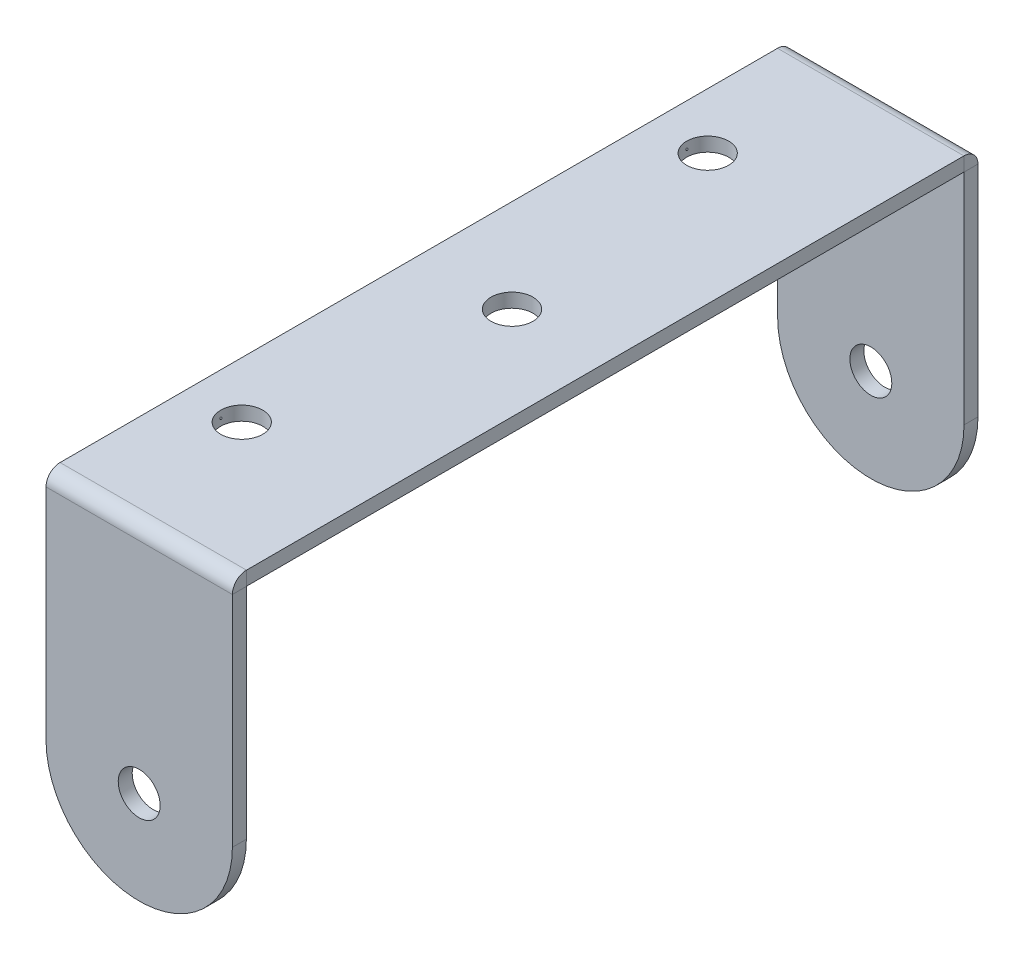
ISO-10303-21;
HEADER;
FILE_DESCRIPTION(('STEP AP214'),'2;1');
FILE_NAME('part.step','',(''),(''),'','','');
FILE_SCHEMA(('AUTOMOTIVE_DESIGN { 1 0 10303 214 1 1 1 1 }'));
ENDSEC;
DATA;
#1=APPLICATION_CONTEXT('core data for automotive mechanical design processes');
#2=APPLICATION_PROTOCOL_DEFINITION('international standard','automotive_design',2000,#1);
#3=PRODUCT_CONTEXT('',#1,'mechanical');
#4=PRODUCT('Part','Part','',(#3));
#5=PRODUCT_RELATED_PRODUCT_CATEGORY('part','',(#4));
#6=PRODUCT_DEFINITION_FORMATION('','',#4);
#7=PRODUCT_DEFINITION_CONTEXT('part definition',#1,'design');
#8=PRODUCT_DEFINITION('design','',#6,#7);
#9=PRODUCT_DEFINITION_SHAPE('','',#8);
#10=(LENGTH_UNIT() NAMED_UNIT(*) SI_UNIT(.MILLI.,.METRE.));
#11=(NAMED_UNIT(*) PLANE_ANGLE_UNIT() SI_UNIT($,.RADIAN.));
#12=(NAMED_UNIT(*) SI_UNIT($,.STERADIAN.) SOLID_ANGLE_UNIT());
#13=UNCERTAINTY_MEASURE_WITH_UNIT(LENGTH_MEASURE(1.E-05),#10,'distance_accuracy_value','');
#14=(GEOMETRIC_REPRESENTATION_CONTEXT(3) GLOBAL_UNCERTAINTY_ASSIGNED_CONTEXT((#13)) GLOBAL_UNIT_ASSIGNED_CONTEXT((#10,
#11,#12)) REPRESENTATION_CONTEXT('',''));
#15=CARTESIAN_POINT('',(0.,0.,0.));
#16=DIRECTION('',(0.,0.,1.));
#17=DIRECTION('',(1.,0.,0.));
#18=AXIS2_PLACEMENT_3D('',#15,#16,#17);
#19=CARTESIAN_POINT('',(10.,1.5,65.));
#20=DIRECTION('',(0.,1.,0.));
#21=DIRECTION('',(0.,0.,1.));
#22=AXIS2_PLACEMENT_3D('',#19,#20,#21);
#23=PLANE('',#22);
#24=CARTESIAN_POINT('',(6.,1.5,-25.));
#25=DIRECTION('',(0.,1.,0.));
#26=DIRECTION('',(0.,0.,1.));
#27=AXIS2_PLACEMENT_3D('',#24,#25,#26);
#28=CIRCLE('',#27,2.25);
#29=CARTESIAN_POINT('',(6.,1.5,-22.75));
#30=VERTEX_POINT('',#29);
#31=EDGE_CURVE('E241',#30,#30,#28,.T.);
#32=ORIENTED_EDGE('',*,*,#31,.F.);
#33=EDGE_LOOP('',(#32));
#34=FACE_BOUND('',#33,.T.);
#35=CARTESIAN_POINT('',(10.,1.5,0.));
#36=DIRECTION('',(0.,1.,0.));
#37=DIRECTION('',(0.,0.,1.));
#38=AXIS2_PLACEMENT_3D('',#35,#36,#37);
#39=CIRCLE('',#38,2.25);
#40=CARTESIAN_POINT('',(10.,1.5,2.25));
#41=VERTEX_POINT('',#40);
#42=EDGE_CURVE('E247',#41,#41,#39,.T.);
#43=ORIENTED_EDGE('',*,*,#42,.F.);
#44=EDGE_LOOP('',(#43));
#45=FACE_BOUND('',#44,.T.);
#46=CARTESIAN_POINT('',(6.,1.5,25.));
#47=DIRECTION('',(0.,1.,0.));
#48=DIRECTION('',(0.,0.,1.));
#49=AXIS2_PLACEMENT_3D('',#46,#47,#48);
#50=CIRCLE('',#49,2.25);
#51=CARTESIAN_POINT('',(6.,1.5,27.25));
#52=VERTEX_POINT('',#51);
#53=EDGE_CURVE('E235',#52,#52,#50,.T.);
#54=ORIENTED_EDGE('',*,*,#53,.F.);
#55=EDGE_LOOP('',(#54));
#56=FACE_BOUND('',#55,.T.);
#57=DIRECTION('',(0.,0.,-1.));
#58=VECTOR('',#57,1.);
#59=CARTESIAN_POINT('',(20.,1.5,65.));
#60=LINE('',#59,#58);
#61=CARTESIAN_POINT('',(20.,1.50000001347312,38.495));
#62=VERTEX_POINT('',#61);
#63=CARTESIAN_POINT('',(20.,1.5,-38.495));
#64=VERTEX_POINT('',#63);
#65=EDGE_CURVE('E273',#62,#64,#60,.T.);
#66=ORIENTED_EDGE('',*,*,#65,.T.);
#67=DIRECTION('',(-1.,0.,0.));
#68=VECTOR('',#67,1.);
#69=CARTESIAN_POINT('',(10.,1.5,-38.495));
#70=LINE('',#69,#68);
#71=CARTESIAN_POINT('',(0.,1.50000002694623,-38.495));
#72=VERTEX_POINT('',#71);
#73=EDGE_CURVE('E260',#64,#72,#70,.T.);
#74=ORIENTED_EDGE('',*,*,#73,.T.);
#75=DIRECTION('',(0.,0.,1.));
#76=VECTOR('',#75,1.);
#77=CARTESIAN_POINT('',(0.,1.5,-65.));
#78=LINE('',#77,#76);
#79=CARTESIAN_POINT('',(0.,1.50000002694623,38.495));
#80=VERTEX_POINT('',#79);
#81=EDGE_CURVE('E253',#72,#80,#78,.T.);
#82=ORIENTED_EDGE('',*,*,#81,.T.);
#83=DIRECTION('',(-1.,0.,0.));
#84=VECTOR('',#83,1.);
#85=CARTESIAN_POINT('',(10.,1.5,38.495));
#86=LINE('',#85,#84);
#87=EDGE_CURVE('E250',#62,#80,#86,.T.);
#88=ORIENTED_EDGE('',*,*,#87,.F.);
#89=EDGE_LOOP('',(#66,#74,#82,#88));
#90=FACE_BOUND('',#89,.T.);
#91=ADVANCED_FACE('F40',(#34,#45,#56,#90),#23,.T.);
#92=CARTESIAN_POINT('',(0.,1.5,-65.));
#93=DIRECTION('',(1.,0.,0.));
#94=DIRECTION('',(0.,0.,-1.));
#95=AXIS2_PLACEMENT_3D('',#92,#93,#94);
#96=PLANE('',#95);
#97=DIRECTION('',(0.,1.,0.));
#98=VECTOR('',#97,1.);
#99=CARTESIAN_POINT('',(0.,1.5,-38.495));
#100=LINE('',#99,#98);
#101=CARTESIAN_POINT('',(0.,0.,-38.495));
#102=VERTEX_POINT('',#101);
#103=EDGE_CURVE('E269',#102,#72,#100,.T.);
#104=ORIENTED_EDGE('',*,*,#103,.F.);
#105=DIRECTION('',(0.,0.,1.));
#106=VECTOR('',#105,1.);
#107=CARTESIAN_POINT('',(0.,0.,-65.));
#108=LINE('',#107,#106);
#109=CARTESIAN_POINT('',(0.,2.69462321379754E-08,38.495));
#110=VERTEX_POINT('',#109);
#111=EDGE_CURVE('E59',#102,#110,#108,.T.);
#112=ORIENTED_EDGE('',*,*,#111,.T.);
#113=DIRECTION('',(0.,1.,0.));
#114=VECTOR('',#113,1.);
#115=CARTESIAN_POINT('',(0.,1.50000000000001,38.495));
#116=LINE('',#115,#114);
#117=EDGE_CURVE('E252',#110,#80,#116,.T.);
#118=ORIENTED_EDGE('',*,*,#117,.T.);
#119=ORIENTED_EDGE('',*,*,#81,.F.);
#120=EDGE_LOOP('',(#104,#112,#118,#119));
#121=FACE_BOUND('',#120,.T.);
#122=ADVANCED_FACE('F42',(#121),#96,.F.);
#123=CARTESIAN_POINT('',(20.,1.5,65.));
#124=DIRECTION('',(-1.,0.,0.));
#125=DIRECTION('',(0.,0.,1.));
#126=AXIS2_PLACEMENT_3D('',#123,#124,#125);
#127=PLANE('',#126);
#128=DIRECTION('',(0.,-1.,0.));
#129=VECTOR('',#128,1.);
#130=CARTESIAN_POINT('',(20.,1.49999999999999,-38.495));
#131=LINE('',#130,#129);
#132=CARTESIAN_POINT('',(20.,0.,-38.495));
#133=VERTEX_POINT('',#132);
#134=EDGE_CURVE('E263',#64,#133,#131,.T.);
#135=ORIENTED_EDGE('',*,*,#134,.F.);
#136=ORIENTED_EDGE('',*,*,#65,.F.);
#137=DIRECTION('',(0.,-1.,0.));
#138=VECTOR('',#137,1.);
#139=CARTESIAN_POINT('',(20.,1.5,38.495));
#140=LINE('',#139,#138);
#141=CARTESIAN_POINT('',(20.,0.,38.495));
#142=VERTEX_POINT('',#141);
#143=EDGE_CURVE('E258',#62,#142,#140,.T.);
#144=ORIENTED_EDGE('',*,*,#143,.T.);
#145=DIRECTION('',(0.,0.,-1.));
#146=VECTOR('',#145,1.);
#147=CARTESIAN_POINT('',(20.,0.,65.));
#148=LINE('',#147,#146);
#149=EDGE_CURVE('E67',#142,#133,#148,.T.);
#150=ORIENTED_EDGE('',*,*,#149,.T.);
#151=EDGE_LOOP('',(#135,#136,#144,#150));
#152=FACE_BOUND('',#151,.T.);
#153=ADVANCED_FACE('F373',(#152),#127,.F.);
#154=CARTESIAN_POINT('',(10.,0.,65.));
#155=DIRECTION('',(0.,1.,0.));
#156=DIRECTION('',(0.,0.,1.));
#157=AXIS2_PLACEMENT_3D('',#154,#155,#156);
#158=PLANE('',#157);
#159=DIRECTION('',(-1.,0.,0.));
#160=VECTOR('',#159,1.);
#161=CARTESIAN_POINT('',(10.,0.,-38.495));
#162=LINE('',#161,#160);
#163=EDGE_CURVE('E266',#133,#102,#162,.T.);
#164=ORIENTED_EDGE('',*,*,#163,.F.);
#165=ORIENTED_EDGE('',*,*,#149,.F.);
#166=DIRECTION('',(-1.,0.,0.));
#167=VECTOR('',#166,1.);
#168=CARTESIAN_POINT('',(10.,0.,38.495));
#169=LINE('',#168,#167);
#170=EDGE_CURVE('E256',#142,#110,#169,.T.);
#171=ORIENTED_EDGE('',*,*,#170,.T.);
#172=ORIENTED_EDGE('',*,*,#111,.F.);
#173=EDGE_LOOP('',(#164,#165,#171,#172));
#174=FACE_BOUND('',#173,.T.);
#175=CARTESIAN_POINT('',(6.,0.,25.));
#176=DIRECTION('',(0.,1.,0.));
#177=DIRECTION('',(0.,0.,1.));
#178=AXIS2_PLACEMENT_3D('',#175,#176,#177);
#179=CIRCLE('',#178,2.25);
#180=CARTESIAN_POINT('',(6.,0.,27.25));
#181=VERTEX_POINT('',#180);
#182=EDGE_CURVE('E232',#181,#181,#179,.T.);
#183=ORIENTED_EDGE('',*,*,#182,.T.);
#184=EDGE_LOOP('',(#183));
#185=FACE_BOUND('',#184,.T.);
#186=CARTESIAN_POINT('',(10.,0.,0.));
#187=DIRECTION('',(0.,1.,0.));
#188=DIRECTION('',(0.,0.,1.));
#189=AXIS2_PLACEMENT_3D('',#186,#187,#188);
#190=CIRCLE('',#189,2.25);
#191=CARTESIAN_POINT('',(10.,0.,2.25));
#192=VERTEX_POINT('',#191);
#193=EDGE_CURVE('E244',#192,#192,#190,.T.);
#194=ORIENTED_EDGE('',*,*,#193,.T.);
#195=EDGE_LOOP('',(#194));
#196=FACE_BOUND('',#195,.T.);
#197=CARTESIAN_POINT('',(6.,0.,-25.));
#198=DIRECTION('',(0.,1.,0.));
#199=DIRECTION('',(0.,0.,1.));
#200=AXIS2_PLACEMENT_3D('',#197,#198,#199);
#201=CIRCLE('',#200,2.25);
#202=CARTESIAN_POINT('',(6.,0.,-22.75));
#203=VERTEX_POINT('',#202);
#204=EDGE_CURVE('E238',#203,#203,#201,.T.);
#205=ORIENTED_EDGE('',*,*,#204,.T.);
#206=EDGE_LOOP('',(#205));
#207=FACE_BOUND('',#206,.T.);
#208=ADVANCED_FACE('F381',(#174,#185,#196,#207),#158,.F.);
#209=CARTESIAN_POINT('',(10.,1.5,0.));
#210=DIRECTION('',(0.,-1.,0.));
#211=DIRECTION('',(0.,0.,-1.));
#212=AXIS2_PLACEMENT_3D('',#209,#210,#211);
#213=CYLINDRICAL_SURFACE('',#212,2.25);
#214=ORIENTED_EDGE('',*,*,#42,.T.);
#215=EDGE_LOOP('',(#214));
#216=FACE_BOUND('',#215,.T.);
#217=ORIENTED_EDGE('',*,*,#193,.F.);
#218=EDGE_LOOP('',(#217));
#219=FACE_BOUND('',#218,.T.);
#220=ADVANCED_FACE('F379',(#216,#219),#213,.F.);
#221=CARTESIAN_POINT('',(6.,1.5,-25.));
#222=DIRECTION('',(0.,-1.,0.));
#223=DIRECTION('',(0.,0.,-1.));
#224=AXIS2_PLACEMENT_3D('',#221,#222,#223);
#225=CYLINDRICAL_SURFACE('',#224,2.25);
#226=CARTESIAN_POINT('',(3.75222222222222,0.75,-25.0999753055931));
#227=CARTESIAN_POINT('',(3.75222219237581,0.755616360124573,-25.0999750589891));
#228=CARTESIAN_POINT('',(3.75220096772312,0.761236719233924,-25.099500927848));
#229=CARTESIAN_POINT('',(3.75211834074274,0.772322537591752,-25.0976160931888));
#230=CARTESIAN_POINT('',(3.75205689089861,0.777787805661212,-25.0962042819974));
#231=CARTESIAN_POINT('',(3.75190077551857,0.788401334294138,-25.0924841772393));
#232=CARTESIAN_POINT('',(3.75180612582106,0.79354974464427,-25.0901763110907));
#233=CARTESIAN_POINT('',(3.75159429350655,0.803384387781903,-25.0847299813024));
#234=CARTESIAN_POINT('',(3.75147711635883,0.808070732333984,-25.081591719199));
#235=CARTESIAN_POINT('',(3.75123339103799,0.81685097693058,-25.0745723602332));
#236=CARTESIAN_POINT('',(3.75110684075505,0.820944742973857,-25.0706910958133));
#237=CARTESIAN_POINT('',(3.75085864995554,0.828422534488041,-25.0622959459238));
#238=CARTESIAN_POINT('',(3.75073700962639,0.831806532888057,-25.0577820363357));
#239=CARTESIAN_POINT('',(3.75051236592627,0.837768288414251,-25.0482501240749));
#240=CARTESIAN_POINT('',(3.75040936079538,0.840346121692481,-25.0432321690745));
#241=CARTESIAN_POINT('',(3.75023358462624,0.844622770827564,-25.0328342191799));
#242=CARTESIAN_POINT('',(3.75016081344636,0.846321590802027,-25.0274542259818));
#243=CARTESIAN_POINT('',(3.75005373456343,0.848791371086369,-25.0164876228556));
#244=CARTESIAN_POINT('',(3.75001940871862,0.849562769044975,-25.0109011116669));
#245=CARTESIAN_POINT('',(3.74999302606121,0.850157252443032,-24.9996777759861));
#246=CARTESIAN_POINT('',(3.75000096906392,0.849980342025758,-24.9940409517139));
#247=CARTESIAN_POINT('',(3.75005821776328,0.848683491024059,-24.9828792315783));
#248=CARTESIAN_POINT('',(3.75010750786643,0.847563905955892,-24.9773542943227));
#249=CARTESIAN_POINT('',(3.75024188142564,0.844413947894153,-24.9665709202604));
#250=CARTESIAN_POINT('',(3.75032696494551,0.842383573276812,-24.9613124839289));
#251=CARTESIAN_POINT('',(3.75052336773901,0.837469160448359,-24.9512102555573));
#252=CARTESIAN_POINT('',(3.75063469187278,0.834584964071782,-24.9463665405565));
#253=CARTESIAN_POINT('',(3.75087103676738,0.828044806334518,-24.9372320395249));
#254=CARTESIAN_POINT('',(3.75099605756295,0.824388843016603,-24.9329412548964));
#255=CARTESIAN_POINT('',(3.7512457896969,0.816406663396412,-24.925031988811));
#256=CARTESIAN_POINT('',(3.75137050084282,0.812080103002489,-24.9214138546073));
#257=CARTESIAN_POINT('',(3.75160549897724,0.802880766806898,-24.9149550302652));
#258=CARTESIAN_POINT('',(3.75171578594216,0.798007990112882,-24.912114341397));
#259=CARTESIAN_POINT('',(3.75190953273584,0.787853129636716,-24.9072901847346));
#260=CARTESIAN_POINT('',(3.75199298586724,0.782570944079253,-24.9053069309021));
#261=CARTESIAN_POINT('',(3.75212361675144,0.771748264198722,-24.9022548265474));
#262=CARTESIAN_POINT('',(3.75217079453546,0.766207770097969,-24.9011859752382));
#263=CARTESIAN_POINT('',(3.75222355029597,0.755026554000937,-24.899993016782));
#264=CARTESIAN_POINT('',(3.75222913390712,0.749385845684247,-24.8998687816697));
#265=CARTESIAN_POINT('',(3.75219808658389,0.738163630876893,-24.9005682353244));
#266=CARTESIAN_POINT('',(3.75216145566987,0.732582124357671,-24.9013919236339));
#267=CARTESIAN_POINT('',(3.75205011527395,0.721637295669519,-24.9039637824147));
#268=CARTESIAN_POINT('',(3.75197540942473,0.716273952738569,-24.9057118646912));
#269=CARTESIAN_POINT('',(3.75179634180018,0.705917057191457,-24.9100829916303));
#270=CARTESIAN_POINT('',(3.75169197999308,0.700923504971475,-24.9127060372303));
#271=CARTESIAN_POINT('',(3.75146534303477,0.691447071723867,-24.9187533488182));
#272=CARTESIAN_POINT('',(3.75134306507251,0.686964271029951,-24.9221777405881));
#273=CARTESIAN_POINT('',(3.75109438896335,0.678637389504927,-24.9297305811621));
#274=CARTESIAN_POINT('',(3.75096799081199,0.674793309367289,-24.9338590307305));
#275=CARTESIAN_POINT('',(3.75072531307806,0.667852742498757,-24.9427032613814));
#276=CARTESIAN_POINT('',(3.75060903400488,0.664756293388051,-24.9474190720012));
#277=CARTESIAN_POINT('',(3.75039970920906,0.65939914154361,-24.9573041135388));
#278=CARTESIAN_POINT('',(3.75030666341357,0.657138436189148,-24.9624733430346));
#279=CARTESIAN_POINT('',(3.75015432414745,0.653517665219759,-24.9731164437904));
#280=CARTESIAN_POINT('',(3.75009501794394,0.652157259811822,-24.9785901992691));
#281=CARTESIAN_POINT('',(3.75001678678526,0.650374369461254,-24.9896886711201));
#282=CARTESIAN_POINT('',(3.74999786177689,0.649951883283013,-24.9953133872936));
#283=CARTESIAN_POINT('',(3.75000252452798,0.650056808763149,-25.0065512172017));
#284=CARTESIAN_POINT('',(3.75002609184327,0.650583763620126,-25.0121643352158));
#285=CARTESIAN_POINT('',(3.7501130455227,0.652571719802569,-25.0232223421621));
#286=CARTESIAN_POINT('',(3.75017643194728,0.654032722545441,-25.028667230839));
#287=CARTESIAN_POINT('',(3.7503358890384,0.657847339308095,-25.0392343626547));
#288=CARTESIAN_POINT('',(3.75043196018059,0.660200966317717,-25.0443566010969));
#289=CARTESIAN_POINT('',(3.75064596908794,0.665733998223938,-25.0541329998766));
#290=CARTESIAN_POINT('',(3.75076390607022,0.66891337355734,-25.0587871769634));
#291=CARTESIAN_POINT('',(3.75100842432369,0.676009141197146,-25.0674975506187));
#292=CARTESIAN_POINT('',(3.75113500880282,0.67992580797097,-25.0715535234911));
#293=CARTESIAN_POINT('',(3.75138255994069,0.688385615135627,-25.0789515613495));
#294=CARTESIAN_POINT('',(3.75150352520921,0.692928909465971,-25.0822934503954));
#295=CARTESIAN_POINT('',(3.75172627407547,0.70251581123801,-25.0881699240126));
#296=CARTESIAN_POINT('',(3.7518280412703,0.707559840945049,-25.0907038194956));
#297=CARTESIAN_POINT('',(3.752000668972,0.717998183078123,-25.0948864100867));
#298=CARTESIAN_POINT('',(3.75207156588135,0.723392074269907,-25.0965361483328));
#299=CARTESIAN_POINT('',(3.75215567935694,0.73234958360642,-25.0984704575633));
#300=CARTESIAN_POINT('',(3.75218052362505,0.735855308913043,-25.0990340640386));
#301=CARTESIAN_POINT('',(3.75221380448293,0.742906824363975,-25.0997865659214));
#302=CARTESIAN_POINT('',(3.75222224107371,0.746452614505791,-25.0999754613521));
#303=CARTESIAN_POINT('',(3.75222222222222,0.75,-25.0999753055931));
#304=B_SPLINE_CURVE_WITH_KNOTS('',3,(#226,#227,#228,#229,#230,#231,#232,#233,#234,#235,#236,
#237,#238,#239,#240,#241,#242,#243,#244,#245,#246,#247,#248,#249,#250,#251,#252,#253,#254,#255,
#256,#257,#258,#259,#260,#261,#262,#263,#264,#265,#266,#267,#268,#269,#270,#271,#272,#273,#274,
#275,#276,#277,#278,#279,#280,#281,#282,#283,#284,#285,#286,#287,#288,#289,#290,#291,#292,#293,
#294,#295,#296,#297,#298,#299,#300,#301,#302,#303),.UNSPECIFIED.,.T.,.F.,(4,2,2,2,2,2,2,2,2,2,2,
2,2,2,2,2,2,2,2,2,2,2,2,2,2,2,2,2,2,2,2,2,2,2,2,2,2,2,4),(0.,0.016836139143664,
0.0336922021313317,0.0505402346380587,0.0673841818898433,0.0842319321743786,0.101080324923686,
0.117927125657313,0.134773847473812,0.15161261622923,0.168451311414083,0.185283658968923,
0.202116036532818,0.218951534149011,0.235787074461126,0.252631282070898,0.269475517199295,
0.286323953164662,0.303172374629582,0.320018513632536,0.33686464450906,0.353709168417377,
0.370553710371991,0.38740089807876,0.404248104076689,0.421096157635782,0.437944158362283,
0.454785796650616,0.471627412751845,0.488460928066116,0.505294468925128,0.522128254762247,
0.538961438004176,0.555800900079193,0.57264450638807,0.589502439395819,0.606340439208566,
0.61697442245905,0.627608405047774),.UNSPECIFIED.);
#305=CARTESIAN_POINT('',(3.75222222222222,0.75,-25.0999753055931));
#306=VERTEX_POINT('',#305);
#307=EDGE_CURVE('E12',#306,#306,#304,.T.);
#308=ORIENTED_EDGE('',*,*,#307,.F.);
#309=EDGE_LOOP('',(#308));
#310=FACE_BOUND('',#309,.T.);
#311=ORIENTED_EDGE('',*,*,#31,.T.);
#312=EDGE_LOOP('',(#311));
#313=FACE_BOUND('',#312,.T.);
#314=ORIENTED_EDGE('',*,*,#204,.F.);
#315=EDGE_LOOP('',(#314));
#316=FACE_BOUND('',#315,.T.);
#317=ADVANCED_FACE('F386',(#310,#313,#316),#225,.F.);
#318=CARTESIAN_POINT('',(6.,1.5,25.));
#319=DIRECTION('',(0.,-1.,0.));
#320=DIRECTION('',(0.,0.,-1.));
#321=AXIS2_PLACEMENT_3D('',#318,#319,#320);
#322=CYLINDRICAL_SURFACE('',#321,2.25);
#323=CARTESIAN_POINT('',(3.75222222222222,0.75,24.9000246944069));
#324=CARTESIAN_POINT('',(3.75222219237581,0.755616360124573,24.9000249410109));
#325=CARTESIAN_POINT('',(3.75220096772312,0.761236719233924,24.900499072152));
#326=CARTESIAN_POINT('',(3.75211834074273,0.772322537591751,24.9023839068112));
#327=CARTESIAN_POINT('',(3.75205689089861,0.777787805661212,24.9037957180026));
#328=CARTESIAN_POINT('',(3.75190077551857,0.788401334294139,24.9075158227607));
#329=CARTESIAN_POINT('',(3.75180612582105,0.793549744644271,24.9098236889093));
#330=CARTESIAN_POINT('',(3.75159429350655,0.803384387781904,24.9152700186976));
#331=CARTESIAN_POINT('',(3.75147711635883,0.808070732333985,24.918408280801));
#332=CARTESIAN_POINT('',(3.75123339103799,0.81685097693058,24.9254276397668));
#333=CARTESIAN_POINT('',(3.75110684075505,0.820944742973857,24.9293089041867));
#334=CARTESIAN_POINT('',(3.75085864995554,0.828422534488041,24.9377040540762));
#335=CARTESIAN_POINT('',(3.75073700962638,0.831806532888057,24.9422179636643));
#336=CARTESIAN_POINT('',(3.75051236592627,0.83776828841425,24.9517498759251));
#337=CARTESIAN_POINT('',(3.75040936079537,0.84034612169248,24.9567678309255));
#338=CARTESIAN_POINT('',(3.75023358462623,0.844622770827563,24.9671657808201));
#339=CARTESIAN_POINT('',(3.75016081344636,0.846321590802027,24.9725457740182));
#340=CARTESIAN_POINT('',(3.75005373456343,0.848791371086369,24.9835123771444));
#341=CARTESIAN_POINT('',(3.75001940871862,0.849562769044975,24.9890988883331));
#342=CARTESIAN_POINT('',(3.7499930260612,0.850157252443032,25.0003222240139));
#343=CARTESIAN_POINT('',(3.75000096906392,0.849980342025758,25.0059590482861));
#344=CARTESIAN_POINT('',(3.75005821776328,0.848683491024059,25.0171207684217));
#345=CARTESIAN_POINT('',(3.75010750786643,0.847563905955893,25.0226457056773));
#346=CARTESIAN_POINT('',(3.75024188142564,0.844413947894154,25.0334290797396));
#347=CARTESIAN_POINT('',(3.75032696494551,0.842383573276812,25.0386875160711));
#348=CARTESIAN_POINT('',(3.75052336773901,0.837469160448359,25.0487897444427));
#349=CARTESIAN_POINT('',(3.75063469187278,0.834584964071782,25.0536334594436));
#350=CARTESIAN_POINT('',(3.75087103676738,0.828044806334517,25.0627679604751));
#351=CARTESIAN_POINT('',(3.75099605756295,0.824388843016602,25.0670587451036));
#352=CARTESIAN_POINT('',(3.75124578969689,0.816406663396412,25.074968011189));
#353=CARTESIAN_POINT('',(3.75137050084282,0.812080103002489,25.0785861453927));
#354=CARTESIAN_POINT('',(3.75160549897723,0.802880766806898,25.0850449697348));
#355=CARTESIAN_POINT('',(3.75171578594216,0.798007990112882,25.087885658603));
#356=CARTESIAN_POINT('',(3.75190953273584,0.787853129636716,25.0927098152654));
#357=CARTESIAN_POINT('',(3.75199298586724,0.782570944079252,25.0946930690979));
#358=CARTESIAN_POINT('',(3.75212361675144,0.771748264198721,25.0977451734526));
#359=CARTESIAN_POINT('',(3.75217079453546,0.766207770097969,25.0988140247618));
#360=CARTESIAN_POINT('',(3.75222355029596,0.755026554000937,25.100006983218));
#361=CARTESIAN_POINT('',(3.75222913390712,0.749385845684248,25.1001312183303));
#362=CARTESIAN_POINT('',(3.75219808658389,0.738163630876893,25.0994317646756));
#363=CARTESIAN_POINT('',(3.75216145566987,0.732582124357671,25.0986080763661));
#364=CARTESIAN_POINT('',(3.75205011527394,0.721637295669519,25.0960362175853));
#365=CARTESIAN_POINT('',(3.75197540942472,0.716273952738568,25.0942881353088));
#366=CARTESIAN_POINT('',(3.75179634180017,0.705917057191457,25.0899170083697));
#367=CARTESIAN_POINT('',(3.75169197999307,0.700923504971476,25.0872939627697));
#368=CARTESIAN_POINT('',(3.75146534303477,0.691447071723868,25.0812466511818));
#369=CARTESIAN_POINT('',(3.75134306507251,0.686964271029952,25.0778222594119));
#370=CARTESIAN_POINT('',(3.75109438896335,0.678637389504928,25.0702694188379));
#371=CARTESIAN_POINT('',(3.75096799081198,0.674793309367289,25.0661409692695));
#372=CARTESIAN_POINT('',(3.75072531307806,0.667852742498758,25.0572967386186));
#373=CARTESIAN_POINT('',(3.75060903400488,0.664756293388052,25.0525809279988));
#374=CARTESIAN_POINT('',(3.75039970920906,0.65939914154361,25.0426958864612));
#375=CARTESIAN_POINT('',(3.75030666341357,0.657138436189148,25.0375266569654));
#376=CARTESIAN_POINT('',(3.75015432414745,0.653517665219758,25.0268835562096));
#377=CARTESIAN_POINT('',(3.75009501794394,0.652157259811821,25.0214098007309));
#378=CARTESIAN_POINT('',(3.75001678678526,0.650374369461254,25.0103113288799));
#379=CARTESIAN_POINT('',(3.74999786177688,0.649951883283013,25.0046866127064));
#380=CARTESIAN_POINT('',(3.75000252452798,0.650056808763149,24.9934487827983));
#381=CARTESIAN_POINT('',(3.75002609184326,0.650583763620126,24.9878356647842));
#382=CARTESIAN_POINT('',(3.7501130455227,0.652571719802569,24.9767776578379));
#383=CARTESIAN_POINT('',(3.75017643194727,0.654032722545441,24.971332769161));
#384=CARTESIAN_POINT('',(3.7503358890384,0.657847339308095,24.9607656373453));
#385=CARTESIAN_POINT('',(3.75043196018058,0.660200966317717,24.9556433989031));
#386=CARTESIAN_POINT('',(3.75064596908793,0.665733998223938,24.9458670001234));
#387=CARTESIAN_POINT('',(3.75076390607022,0.66891337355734,24.9412128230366));
#388=CARTESIAN_POINT('',(3.75100842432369,0.676009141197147,24.9325024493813));
#389=CARTESIAN_POINT('',(3.75113500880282,0.679925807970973,24.9284464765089));
#390=CARTESIAN_POINT('',(3.75138255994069,0.688385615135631,24.9210484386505));
#391=CARTESIAN_POINT('',(3.75150352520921,0.692928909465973,24.9177065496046));
#392=CARTESIAN_POINT('',(3.75172627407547,0.702515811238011,24.9118300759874));
#393=CARTESIAN_POINT('',(3.7518280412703,0.707559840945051,24.9092961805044));
#394=CARTESIAN_POINT('',(3.752000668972,0.717998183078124,24.9051135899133));
#395=CARTESIAN_POINT('',(3.75207156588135,0.723392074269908,24.9034638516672));
#396=CARTESIAN_POINT('',(3.75215567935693,0.73234958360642,24.9015295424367));
#397=CARTESIAN_POINT('',(3.75218052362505,0.735855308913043,24.9009659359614));
#398=CARTESIAN_POINT('',(3.75221380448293,0.742906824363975,24.9002134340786));
#399=CARTESIAN_POINT('',(3.75222224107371,0.746452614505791,24.9000245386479));
#400=CARTESIAN_POINT('',(3.75222222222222,0.75,24.9000246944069));
#401=B_SPLINE_CURVE_WITH_KNOTS('',3,(#323,#324,#325,#326,#327,#328,#329,#330,#331,#332,#333,
#334,#335,#336,#337,#338,#339,#340,#341,#342,#343,#344,#345,#346,#347,#348,#349,#350,#351,#352,
#353,#354,#355,#356,#357,#358,#359,#360,#361,#362,#363,#364,#365,#366,#367,#368,#369,#370,#371,
#372,#373,#374,#375,#376,#377,#378,#379,#380,#381,#382,#383,#384,#385,#386,#387,#388,#389,#390,
#391,#392,#393,#394,#395,#396,#397,#398,#399,#400),.UNSPECIFIED.,.T.,.F.,(4,2,2,2,2,2,2,2,2,2,2,
2,2,2,2,2,2,2,2,2,2,2,2,2,2,2,2,2,2,2,2,2,2,2,2,2,2,2,4),(0.,0.0168361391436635,
0.0336922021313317,0.05054023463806,0.0673841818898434,0.0842319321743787,0.101080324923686,
0.117927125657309,0.134773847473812,0.15161261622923,0.168451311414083,0.185283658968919,
0.202116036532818,0.218951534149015,0.235787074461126,0.252631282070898,0.269475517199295,
0.286323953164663,0.303172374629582,0.320018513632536,0.33686464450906,0.353709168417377,
0.370553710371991,0.387400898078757,0.404248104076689,0.421096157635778,0.437944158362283,
0.454785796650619,0.471627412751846,0.488460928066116,0.505294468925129,0.522128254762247,
0.538961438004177,0.5558009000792,0.57264450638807,0.589502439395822,0.606340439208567,
0.61697442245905,0.627608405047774),.UNSPECIFIED.);
#402=CARTESIAN_POINT('',(3.75222222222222,0.75,24.9000246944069));
#403=VERTEX_POINT('',#402);
#404=EDGE_CURVE('E52',#403,#403,#401,.T.);
#405=ORIENTED_EDGE('',*,*,#404,.F.);
#406=EDGE_LOOP('',(#405));
#407=FACE_BOUND('',#406,.T.);
#408=ORIENTED_EDGE('',*,*,#53,.T.);
#409=EDGE_LOOP('',(#408));
#410=FACE_BOUND('',#409,.T.);
#411=ORIENTED_EDGE('',*,*,#182,.F.);
#412=EDGE_LOOP('',(#411));
#413=FACE_BOUND('',#412,.T.);
#414=ADVANCED_FACE('F282',(#407,#410,#413),#322,.F.);
#415=CARTESIAN_POINT('',(20.,-0.0100000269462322,38.495));
#416=DIRECTION('',(1.,0.,0.));
#417=DIRECTION('',(0.,0.,-1.));
#418=AXIS2_PLACEMENT_3D('',#415,#416,#417);
#419=PLANE('',#418);
#420=DIRECTION('',(0.,0.,-1.));
#421=VECTOR('',#420,1.);
#422=CARTESIAN_POINT('',(20.,-0.0100000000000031,40.005));
#423=LINE('',#422,#421);
#424=CARTESIAN_POINT('',(20.,-0.010000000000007,40.0050000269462));
#425=VERTEX_POINT('',#424);
#426=CARTESIAN_POINT('',(20.,-0.00999999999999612,38.505));
#427=VERTEX_POINT('',#426);
#428=EDGE_CURVE('E183',#425,#427,#423,.T.);
#429=ORIENTED_EDGE('',*,*,#428,.T.);
#430=CARTESIAN_POINT('',(20.,-0.01,38.495));
#431=DIRECTION('',(1.,0.,0.));
#432=DIRECTION('',(0.,0.,-1.));
#433=AXIS2_PLACEMENT_3D('',#430,#431,#432);
#434=CIRCLE('',#433,0.0100000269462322);
#435=EDGE_CURVE('E186',#427,#142,#434,.F.);
#436=ORIENTED_EDGE('',*,*,#435,.T.);
#437=ORIENTED_EDGE('',*,*,#143,.F.);
#438=CARTESIAN_POINT('',(20.,-0.0100000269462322,38.495));
#439=DIRECTION('',(-1.,0.,0.));
#440=DIRECTION('',(0.,0.,1.));
#441=AXIS2_PLACEMENT_3D('',#438,#439,#440);
#442=CIRCLE('',#441,1.51000004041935);
#443=EDGE_CURVE('E226',#425,#62,#442,.T.);
#444=ORIENTED_EDGE('',*,*,#443,.F.);
#445=EDGE_LOOP('',(#429,#436,#437,#444));
#446=FACE_BOUND('',#445,.T.);
#447=ADVANCED_FACE('F360',(#446),#419,.T.);
#448=CARTESIAN_POINT('',(0.,-0.0100000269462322,38.495));
#449=DIRECTION('',(-1.,0.,0.));
#450=DIRECTION('',(0.,0.,1.));
#451=AXIS2_PLACEMENT_3D('',#448,#449,#450);
#452=PLANE('',#451);
#453=CARTESIAN_POINT('',(0.,-0.01,38.495));
#454=DIRECTION('',(1.,0.,0.));
#455=DIRECTION('',(0.,0.,-1.));
#456=AXIS2_PLACEMENT_3D('',#453,#454,#455);
#457=CIRCLE('',#456,0.0100000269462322);
#458=CARTESIAN_POINT('',(0.,-0.0100000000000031,38.505));
#459=VERTEX_POINT('',#458);
#460=EDGE_CURVE('E223',#110,#459,#457,.T.);
#461=ORIENTED_EDGE('',*,*,#460,.T.);
#462=DIRECTION('',(0.,0.,1.));
#463=VECTOR('',#462,1.);
#464=CARTESIAN_POINT('',(0.,-0.01000000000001,40.005));
#465=LINE('',#464,#463);
#466=CARTESIAN_POINT('',(0.,-0.01000000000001,40.005));
#467=VERTEX_POINT('',#466);
#468=EDGE_CURVE('E214',#459,#467,#465,.T.);
#469=ORIENTED_EDGE('',*,*,#468,.T.);
#470=CARTESIAN_POINT('',(0.,-0.0100000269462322,38.495));
#471=DIRECTION('',(1.,0.,0.));
#472=DIRECTION('',(0.,0.,-1.));
#473=AXIS2_PLACEMENT_3D('',#470,#471,#472);
#474=CIRCLE('',#473,1.51000004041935);
#475=EDGE_CURVE('E229',#80,#467,#474,.T.);
#476=ORIENTED_EDGE('',*,*,#475,.F.);
#477=ORIENTED_EDGE('',*,*,#117,.F.);
#478=EDGE_LOOP('',(#461,#469,#476,#477));
#479=FACE_BOUND('',#478,.T.);
#480=ADVANCED_FACE('F356',(#479),#452,.T.);
#481=CARTESIAN_POINT('',(-10.280781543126,-0.01,38.495));
#482=DIRECTION('',(1.,0.,0.));
#483=DIRECTION('',(0.,0.,-1.));
#484=AXIS2_PLACEMENT_3D('',#481,#482,#483);
#485=CYLINDRICAL_SURFACE('',#484,1.51000002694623);
#486=ORIENTED_EDGE('',*,*,#87,.T.);
#487=ORIENTED_EDGE('',*,*,#475,.T.);
#488=DIRECTION('',(-1.,0.,0.));
#489=VECTOR('',#488,1.);
#490=CARTESIAN_POINT('',(10.,-0.0100000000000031,40.005));
#491=LINE('',#490,#489);
#492=EDGE_CURVE('E200',#425,#467,#491,.T.);
#493=ORIENTED_EDGE('',*,*,#492,.F.);
#494=ORIENTED_EDGE('',*,*,#443,.T.);
#495=EDGE_LOOP('',(#486,#487,#493,#494));
#496=FACE_BOUND('',#495,.T.);
#497=ADVANCED_FACE('F354',(#496),#485,.T.);
#498=CARTESIAN_POINT('',(-10.280781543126,-0.01,38.495));
#499=DIRECTION('',(1.,0.,0.));
#500=DIRECTION('',(0.,0.,-1.));
#501=AXIS2_PLACEMENT_3D('',#498,#499,#500);
#502=CYLINDRICAL_SURFACE('',#501,0.0100000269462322);
#503=ORIENTED_EDGE('',*,*,#170,.F.);
#504=ORIENTED_EDGE('',*,*,#435,.F.);
#505=DIRECTION('',(-1.,0.,0.));
#506=VECTOR('',#505,1.);
#507=CARTESIAN_POINT('',(10.,-0.00999999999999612,38.505));
#508=LINE('',#507,#506);
#509=EDGE_CURVE('E217',#427,#459,#508,.T.);
#510=ORIENTED_EDGE('',*,*,#509,.T.);
#511=ORIENTED_EDGE('',*,*,#460,.F.);
#512=EDGE_LOOP('',(#503,#504,#510,#511));
#513=FACE_BOUND('',#512,.T.);
#514=ADVANCED_FACE('F332',(#513),#502,.F.);
#515=CARTESIAN_POINT('',(10.,-23.505,40.0049999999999));
#516=DIRECTION('',(0.,0.,-1.));
#517=DIRECTION('',(0.,1.,0.));
#518=AXIS2_PLACEMENT_3D('',#515,#516,#517);
#519=CYLINDRICAL_SURFACE('',#518,10.);
#520=CARTESIAN_POINT('',(10.,-23.505,38.5049999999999));
#521=DIRECTION('',(0.,0.,1.));
#522=DIRECTION('',(0.,-1.,0.));
#523=AXIS2_PLACEMENT_3D('',#520,#521,#522);
#524=CIRCLE('',#523,10.);
#525=CARTESIAN_POINT('',(0.,-23.505,38.5049999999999));
#526=VERTEX_POINT('',#525);
#527=CARTESIAN_POINT('',(20.,-23.505,38.5049999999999));
#528=VERTEX_POINT('',#527);
#529=EDGE_CURVE('E211',#526,#528,#524,.T.);
#530=ORIENTED_EDGE('',*,*,#529,.T.);
#531=DIRECTION('',(0.,0.,-1.));
#532=VECTOR('',#531,1.);
#533=CARTESIAN_POINT('',(20.,-23.505,40.0049999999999));
#534=LINE('',#533,#532);
#535=CARTESIAN_POINT('',(20.,-23.505,40.0049999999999));
#536=VERTEX_POINT('',#535);
#537=EDGE_CURVE('E187',#536,#528,#534,.T.);
#538=ORIENTED_EDGE('',*,*,#537,.F.);
#539=CARTESIAN_POINT('',(10.,-23.505,40.0049999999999));
#540=DIRECTION('',(0.,0.,1.));
#541=DIRECTION('',(0.,-1.,0.));
#542=AXIS2_PLACEMENT_3D('',#539,#540,#541);
#543=CIRCLE('',#542,10.);
#544=CARTESIAN_POINT('',(0.,-23.505,40.0049999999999));
#545=VERTEX_POINT('',#544);
#546=EDGE_CURVE('E195',#545,#536,#543,.T.);
#547=ORIENTED_EDGE('',*,*,#546,.F.);
#548=DIRECTION('',(0.,0.,-1.));
#549=VECTOR('',#548,1.);
#550=CARTESIAN_POINT('',(0.,-23.505,40.0049999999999));
#551=LINE('',#550,#549);
#552=EDGE_CURVE('E208',#545,#526,#551,.T.);
#553=ORIENTED_EDGE('',*,*,#552,.T.);
#554=EDGE_LOOP('',(#530,#538,#547,#553));
#555=FACE_BOUND('',#554,.T.);
#556=ADVANCED_FACE('F328',(#555),#519,.T.);
#557=CARTESIAN_POINT('',(10.,-23.505,40.0049999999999));
#558=DIRECTION('',(0.,0.,-1.));
#559=DIRECTION('',(0.,1.,0.));
#560=AXIS2_PLACEMENT_3D('',#557,#558,#559);
#561=CYLINDRICAL_SURFACE('',#560,2.25);
#562=CARTESIAN_POINT('',(10.,-23.505,40.0049999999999));
#563=DIRECTION('',(0.,0.,1.));
#564=DIRECTION('',(0.,-1.,0.));
#565=AXIS2_PLACEMENT_3D('',#562,#563,#564);
#566=CIRCLE('',#565,2.25);
#567=CARTESIAN_POINT('',(10.,-25.755,40.0049999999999));
#568=VERTEX_POINT('',#567);
#569=EDGE_CURVE('E205',#568,#568,#566,.T.);
#570=ORIENTED_EDGE('',*,*,#569,.T.);
#571=EDGE_LOOP('',(#570));
#572=FACE_BOUND('',#571,.T.);
#573=CARTESIAN_POINT('',(10.,-23.505,38.5049999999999));
#574=DIRECTION('',(0.,0.,1.));
#575=DIRECTION('',(0.,-1.,0.));
#576=AXIS2_PLACEMENT_3D('',#573,#574,#575);
#577=CIRCLE('',#576,2.25);
#578=CARTESIAN_POINT('',(10.,-25.755,38.5049999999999));
#579=VERTEX_POINT('',#578);
#580=EDGE_CURVE('E190',#579,#579,#577,.T.);
#581=ORIENTED_EDGE('',*,*,#580,.F.);
#582=EDGE_LOOP('',(#581));
#583=FACE_BOUND('',#582,.T.);
#584=ADVANCED_FACE('F331',(#572,#583),#561,.F.);
#585=CARTESIAN_POINT('',(10.,-23.505,40.0049999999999));
#586=DIRECTION('',(0.,0.,1.));
#587=DIRECTION('',(0.,-1.,0.));
#588=AXIS2_PLACEMENT_3D('',#585,#586,#587);
#589=PLANE('',#588);
#590=ORIENTED_EDGE('',*,*,#569,.F.);
#591=EDGE_LOOP('',(#590));
#592=FACE_BOUND('',#591,.T.);
#593=DIRECTION('',(0.,1.,0.));
#594=VECTOR('',#593,1.);
#595=CARTESIAN_POINT('',(20.,-23.505,40.0049999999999));
#596=LINE('',#595,#594);
#597=EDGE_CURVE('E202',#536,#425,#596,.T.);
#598=ORIENTED_EDGE('',*,*,#597,.T.);
#599=ORIENTED_EDGE('',*,*,#492,.T.);
#600=DIRECTION('',(0.,-1.,0.));
#601=VECTOR('',#600,1.);
#602=CARTESIAN_POINT('',(0.,106.495,40.0050000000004));
#603=LINE('',#602,#601);
#604=EDGE_CURVE('E198',#467,#545,#603,.T.);
#605=ORIENTED_EDGE('',*,*,#604,.T.);
#606=ORIENTED_EDGE('',*,*,#546,.T.);
#607=EDGE_LOOP('',(#598,#599,#605,#606));
#608=FACE_BOUND('',#607,.T.);
#609=ADVANCED_FACE('F336',(#592,#608),#589,.T.);
#610=CARTESIAN_POINT('',(0.,106.495,40.0050000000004));
#611=DIRECTION('',(1.,0.,0.));
#612=DIRECTION('',(0.,1.,0.));
#613=AXIS2_PLACEMENT_3D('',#610,#611,#612);
#614=PLANE('',#613);
#615=ORIENTED_EDGE('',*,*,#468,.F.);
#616=DIRECTION('',(0.,-1.,0.));
#617=VECTOR('',#616,1.);
#618=CARTESIAN_POINT('',(0.,106.495,38.5050000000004));
#619=LINE('',#618,#617);
#620=EDGE_CURVE('E193',#459,#526,#619,.T.);
#621=ORIENTED_EDGE('',*,*,#620,.T.);
#622=ORIENTED_EDGE('',*,*,#552,.F.);
#623=ORIENTED_EDGE('',*,*,#604,.F.);
#624=EDGE_LOOP('',(#615,#621,#622,#623));
#625=FACE_BOUND('',#624,.T.);
#626=ADVANCED_FACE('F340',(#625),#614,.F.);
#627=CARTESIAN_POINT('',(10.,-23.505,38.5049999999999));
#628=DIRECTION('',(0.,0.,1.));
#629=DIRECTION('',(0.,-1.,0.));
#630=AXIS2_PLACEMENT_3D('',#627,#628,#629);
#631=PLANE('',#630);
#632=ORIENTED_EDGE('',*,*,#509,.F.);
#633=DIRECTION('',(0.,1.,0.));
#634=VECTOR('',#633,1.);
#635=CARTESIAN_POINT('',(20.,-23.505,38.5049999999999));
#636=LINE('',#635,#634);
#637=EDGE_CURVE('E184',#528,#427,#636,.T.);
#638=ORIENTED_EDGE('',*,*,#637,.F.);
#639=ORIENTED_EDGE('',*,*,#529,.F.);
#640=ORIENTED_EDGE('',*,*,#620,.F.);
#641=EDGE_LOOP('',(#632,#638,#639,#640));
#642=FACE_BOUND('',#641,.T.);
#643=ORIENTED_EDGE('',*,*,#580,.T.);
#644=EDGE_LOOP('',(#643));
#645=FACE_BOUND('',#644,.T.);
#646=ADVANCED_FACE('F344',(#642,#645),#631,.F.);
#647=CARTESIAN_POINT('',(20.,-23.505,40.0049999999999));
#648=DIRECTION('',(-1.,0.,0.));
#649=DIRECTION('',(0.,-1.,0.));
#650=AXIS2_PLACEMENT_3D('',#647,#648,#649);
#651=PLANE('',#650);
#652=ORIENTED_EDGE('',*,*,#428,.F.);
#653=ORIENTED_EDGE('',*,*,#597,.F.);
#654=ORIENTED_EDGE('',*,*,#537,.T.);
#655=ORIENTED_EDGE('',*,*,#637,.T.);
#656=EDGE_LOOP('',(#652,#653,#654,#655));
#657=FACE_BOUND('',#656,.T.);
#658=ADVANCED_FACE('F323',(#657),#651,.F.);
#659=CARTESIAN_POINT('',(20.,-0.0100000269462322,-38.495));
#660=DIRECTION('',(1.,0.,0.));
#661=DIRECTION('',(0.,0.,-1.));
#662=AXIS2_PLACEMENT_3D('',#659,#660,#661);
#663=PLANE('',#662);
#664=ORIENTED_EDGE('',*,*,#134,.T.);
#665=CARTESIAN_POINT('',(20.,-0.01,-38.495));
#666=DIRECTION('',(-1.,0.,0.));
#667=DIRECTION('',(0.,0.,1.));
#668=AXIS2_PLACEMENT_3D('',#665,#666,#667);
#669=CIRCLE('',#668,0.0100000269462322);
#670=CARTESIAN_POINT('',(20.,-0.00999999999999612,-38.505));
#671=VERTEX_POINT('',#670);
#672=EDGE_CURVE('E170',#133,#671,#669,.T.);
#673=ORIENTED_EDGE('',*,*,#672,.T.);
#674=DIRECTION('',(0.,0.,1.));
#675=VECTOR('',#674,1.);
#676=CARTESIAN_POINT('',(20.,-0.0100000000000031,-40.005));
#677=LINE('',#676,#675);
#678=CARTESIAN_POINT('',(20.,-0.0100000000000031,-40.005));
#679=VERTEX_POINT('',#678);
#680=EDGE_CURVE('E143',#679,#671,#677,.T.);
#681=ORIENTED_EDGE('',*,*,#680,.F.);
#682=CARTESIAN_POINT('',(20.,-0.0100000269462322,-38.495));
#683=DIRECTION('',(-1.,0.,0.));
#684=DIRECTION('',(0.,0.,1.));
#685=AXIS2_PLACEMENT_3D('',#682,#683,#684);
#686=CIRCLE('',#685,1.51000004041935);
#687=EDGE_CURVE('E177',#64,#679,#686,.T.);
#688=ORIENTED_EDGE('',*,*,#687,.F.);
#689=EDGE_LOOP('',(#664,#673,#681,#688));
#690=FACE_BOUND('',#689,.T.);
#691=ADVANCED_FACE('F320',(#690),#663,.T.);
#692=CARTESIAN_POINT('',(0.,-0.0100000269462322,-38.495));
#693=DIRECTION('',(-1.,0.,0.));
#694=DIRECTION('',(0.,0.,1.));
#695=AXIS2_PLACEMENT_3D('',#692,#693,#694);
#696=PLANE('',#695);
#697=CARTESIAN_POINT('',(0.,-0.01,-38.495));
#698=DIRECTION('',(-1.,0.,0.));
#699=DIRECTION('',(0.,0.,1.));
#700=AXIS2_PLACEMENT_3D('',#697,#698,#699);
#701=CIRCLE('',#700,0.0100000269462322);
#702=CARTESIAN_POINT('',(0.,-0.00999999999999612,-38.505));
#703=VERTEX_POINT('',#702);
#704=EDGE_CURVE('E173',#703,#102,#701,.F.);
#705=ORIENTED_EDGE('',*,*,#704,.T.);
#706=ORIENTED_EDGE('',*,*,#103,.T.);
#707=CARTESIAN_POINT('',(0.,-0.0100000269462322,-38.495));
#708=DIRECTION('',(1.,0.,0.));
#709=DIRECTION('',(0.,0.,-1.));
#710=AXIS2_PLACEMENT_3D('',#707,#708,#709);
#711=CIRCLE('',#710,1.51000004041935);
#712=CARTESIAN_POINT('',(0.,-0.0100000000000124,-40.0050000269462));
#713=VERTEX_POINT('',#712);
#714=EDGE_CURVE('E180',#713,#72,#711,.T.);
#715=ORIENTED_EDGE('',*,*,#714,.F.);
#716=DIRECTION('',(0.,0.,-1.));
#717=VECTOR('',#716,1.);
#718=CARTESIAN_POINT('',(0.,-0.00999999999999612,-40.005));
#719=LINE('',#718,#717);
#720=EDGE_CURVE('E647',#703,#713,#719,.T.);
#721=ORIENTED_EDGE('',*,*,#720,.F.);
#722=EDGE_LOOP('',(#705,#706,#715,#721));
#723=FACE_BOUND('',#722,.T.);
#724=ADVANCED_FACE('F316',(#723),#696,.T.);
#725=CARTESIAN_POINT('',(30.280781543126,-0.01,-38.495));
#726=DIRECTION('',(-1.,0.,0.));
#727=DIRECTION('',(0.,0.,1.));
#728=AXIS2_PLACEMENT_3D('',#725,#726,#727);
#729=CYLINDRICAL_SURFACE('',#728,1.51000002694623);
#730=DIRECTION('',(-1.,0.,0.));
#731=VECTOR('',#730,1.);
#732=CARTESIAN_POINT('',(10.,-0.0100000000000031,-40.005));
#733=LINE('',#732,#731);
#734=EDGE_CURVE('E164',#679,#713,#733,.T.);
#735=ORIENTED_EDGE('',*,*,#734,.T.);
#736=ORIENTED_EDGE('',*,*,#714,.T.);
#737=ORIENTED_EDGE('',*,*,#73,.F.);
#738=ORIENTED_EDGE('',*,*,#687,.T.);
#739=EDGE_LOOP('',(#735,#736,#737,#738));
#740=FACE_BOUND('',#739,.T.);
#741=ADVANCED_FACE('F314',(#740),#729,.T.);
#742=CARTESIAN_POINT('',(30.280781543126,-0.01,-38.495));
#743=DIRECTION('',(-1.,0.,0.));
#744=DIRECTION('',(0.,0.,1.));
#745=AXIS2_PLACEMENT_3D('',#742,#743,#744);
#746=CYLINDRICAL_SURFACE('',#745,0.0100000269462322);
#747=DIRECTION('',(-1.,0.,0.));
#748=VECTOR('',#747,1.);
#749=CARTESIAN_POINT('',(10.,-0.00999999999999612,-38.505));
#750=LINE('',#749,#748);
#751=EDGE_CURVE('E649',#671,#703,#750,.T.);
#752=ORIENTED_EDGE('',*,*,#751,.F.);
#753=ORIENTED_EDGE('',*,*,#672,.F.);
#754=ORIENTED_EDGE('',*,*,#163,.T.);
#755=ORIENTED_EDGE('',*,*,#704,.F.);
#756=EDGE_LOOP('',(#752,#753,#754,#755));
#757=FACE_BOUND('',#756,.T.);
#758=ADVANCED_FACE('F296',(#757),#746,.F.);
#759=CARTESIAN_POINT('',(10.,-23.505,-40.0049999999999));
#760=DIRECTION('',(0.,0.,1.));
#761=DIRECTION('',(0.,-1.,0.));
#762=AXIS2_PLACEMENT_3D('',#759,#760,#761);
#763=CYLINDRICAL_SURFACE('',#762,2.25);
#764=CARTESIAN_POINT('',(10.,-23.505,-40.0049999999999));
#765=DIRECTION('',(0.,0.,-1.));
#766=DIRECTION('',(0.,1.,0.));
#767=AXIS2_PLACEMENT_3D('',#764,#765,#766);
#768=CIRCLE('',#767,2.25);
#769=CARTESIAN_POINT('',(10.,-21.255,-40.0049999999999));
#770=VERTEX_POINT('',#769);
#771=EDGE_CURVE('E161',#770,#770,#768,.T.);
#772=ORIENTED_EDGE('',*,*,#771,.T.);
#773=EDGE_LOOP('',(#772));
#774=FACE_BOUND('',#773,.T.);
#775=CARTESIAN_POINT('',(10.,-23.505,-38.5049999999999));
#776=DIRECTION('',(0.,0.,-1.));
#777=DIRECTION('',(0.,1.,0.));
#778=AXIS2_PLACEMENT_3D('',#775,#776,#777);
#779=CIRCLE('',#778,2.25);
#780=CARTESIAN_POINT('',(10.,-21.255,-38.5049999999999));
#781=VERTEX_POINT('',#780);
#782=EDGE_CURVE('E148',#781,#781,#779,.T.);
#783=ORIENTED_EDGE('',*,*,#782,.F.);
#784=EDGE_LOOP('',(#783));
#785=FACE_BOUND('',#784,.T.);
#786=ADVANCED_FACE('F293',(#774,#785),#763,.F.);
#787=CARTESIAN_POINT('',(10.,-23.505,-40.0049999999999));
#788=DIRECTION('',(0.,0.,1.));
#789=DIRECTION('',(0.,-1.,0.));
#790=AXIS2_PLACEMENT_3D('',#787,#788,#789);
#791=CYLINDRICAL_SURFACE('',#790,10.);
#792=CARTESIAN_POINT('',(10.,-23.505,-38.5049999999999));
#793=DIRECTION('',(0.,0.,-1.));
#794=DIRECTION('',(0.,1.,0.));
#795=AXIS2_PLACEMENT_3D('',#792,#793,#794);
#796=CIRCLE('',#795,10.);
#797=CARTESIAN_POINT('',(20.,-23.505,-38.5049999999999));
#798=VERTEX_POINT('',#797);
#799=CARTESIAN_POINT('',(0.,-23.505,-38.5049999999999));
#800=VERTEX_POINT('',#799);
#801=EDGE_CURVE('E153',#798,#800,#796,.T.);
#802=ORIENTED_EDGE('',*,*,#801,.T.);
#803=DIRECTION('',(0.,0.,1.));
#804=VECTOR('',#803,1.);
#805=CARTESIAN_POINT('',(0.,-23.505,-40.0049999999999));
#806=LINE('',#805,#804);
#807=CARTESIAN_POINT('',(0.,-23.505,-40.0049999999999));
#808=VERTEX_POINT('',#807);
#809=EDGE_CURVE('E174',#808,#800,#806,.T.);
#810=ORIENTED_EDGE('',*,*,#809,.F.);
#811=CARTESIAN_POINT('',(10.,-23.505,-40.0049999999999));
#812=DIRECTION('',(0.,0.,-1.));
#813=DIRECTION('',(0.,1.,0.));
#814=AXIS2_PLACEMENT_3D('',#811,#812,#813);
#815=CIRCLE('',#814,10.);
#816=CARTESIAN_POINT('',(20.,-23.505,-40.0049999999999));
#817=VERTEX_POINT('',#816);
#818=EDGE_CURVE('E155',#817,#808,#815,.T.);
#819=ORIENTED_EDGE('',*,*,#818,.F.);
#820=DIRECTION('',(0.,0.,1.));
#821=VECTOR('',#820,1.);
#822=CARTESIAN_POINT('',(20.,-23.505,-40.0049999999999));
#823=LINE('',#822,#821);
#824=EDGE_CURVE('E140',#817,#798,#823,.T.);
#825=ORIENTED_EDGE('',*,*,#824,.T.);
#826=EDGE_LOOP('',(#802,#810,#819,#825));
#827=FACE_BOUND('',#826,.T.);
#828=ADVANCED_FACE('F151',(#827),#791,.T.);
#829=CARTESIAN_POINT('',(10.,106.495,-40.0050000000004));
#830=DIRECTION('',(0.,0.,-1.));
#831=DIRECTION('',(0.,1.,0.));
#832=AXIS2_PLACEMENT_3D('',#829,#830,#831);
#833=PLANE('',#832);
#834=ORIENTED_EDGE('',*,*,#734,.F.);
#835=DIRECTION('',(0.,-1.,0.));
#836=VECTOR('',#835,1.);
#837=CARTESIAN_POINT('',(20.,106.495,-40.0050000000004));
#838=LINE('',#837,#836);
#839=EDGE_CURVE('E156',#679,#817,#838,.T.);
#840=ORIENTED_EDGE('',*,*,#839,.T.);
#841=ORIENTED_EDGE('',*,*,#818,.T.);
#842=DIRECTION('',(0.,1.,0.));
#843=VECTOR('',#842,1.);
#844=CARTESIAN_POINT('',(0.,-23.505,-40.0049999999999));
#845=LINE('',#844,#843);
#846=EDGE_CURVE('E638',#808,#713,#845,.T.);
#847=ORIENTED_EDGE('',*,*,#846,.T.);
#848=EDGE_LOOP('',(#834,#840,#841,#847));
#849=FACE_BOUND('',#848,.T.);
#850=ORIENTED_EDGE('',*,*,#771,.F.);
#851=EDGE_LOOP('',(#850));
#852=FACE_BOUND('',#851,.T.);
#853=ADVANCED_FACE('F300',(#849,#852),#833,.T.);
#854=CARTESIAN_POINT('',(20.,106.495,-40.0050000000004));
#855=DIRECTION('',(-1.,0.,0.));
#856=DIRECTION('',(0.,1.,0.));
#857=AXIS2_PLACEMENT_3D('',#854,#855,#856);
#858=PLANE('',#857);
#859=ORIENTED_EDGE('',*,*,#839,.F.);
#860=ORIENTED_EDGE('',*,*,#680,.T.);
#861=DIRECTION('',(0.,-1.,0.));
#862=VECTOR('',#861,1.);
#863=CARTESIAN_POINT('',(20.,106.495,-38.5050000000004));
#864=LINE('',#863,#862);
#865=EDGE_CURVE('E136',#671,#798,#864,.T.);
#866=ORIENTED_EDGE('',*,*,#865,.T.);
#867=ORIENTED_EDGE('',*,*,#824,.F.);
#868=EDGE_LOOP('',(#859,#860,#866,#867));
#869=FACE_BOUND('',#868,.T.);
#870=ADVANCED_FACE('F139',(#869),#858,.F.);
#871=CARTESIAN_POINT('',(10.,106.495,-38.5050000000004));
#872=DIRECTION('',(0.,0.,-1.));
#873=DIRECTION('',(0.,1.,0.));
#874=AXIS2_PLACEMENT_3D('',#871,#872,#873);
#875=PLANE('',#874);
#876=ORIENTED_EDGE('',*,*,#782,.T.);
#877=EDGE_LOOP('',(#876));
#878=FACE_BOUND('',#877,.T.);
#879=ORIENTED_EDGE('',*,*,#865,.F.);
#880=ORIENTED_EDGE('',*,*,#751,.T.);
#881=DIRECTION('',(0.,1.,0.));
#882=VECTOR('',#881,1.);
#883=CARTESIAN_POINT('',(0.,-23.505,-38.5049999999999));
#884=LINE('',#883,#882);
#885=EDGE_CURVE('E160',#800,#703,#884,.T.);
#886=ORIENTED_EDGE('',*,*,#885,.F.);
#887=ORIENTED_EDGE('',*,*,#801,.F.);
#888=EDGE_LOOP('',(#879,#880,#886,#887));
#889=FACE_BOUND('',#888,.T.);
#890=ADVANCED_FACE('F159',(#878,#889),#875,.F.);
#891=CARTESIAN_POINT('',(0.,-23.505,-40.0049999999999));
#892=DIRECTION('',(1.,0.,0.));
#893=DIRECTION('',(0.,-1.,0.));
#894=AXIS2_PLACEMENT_3D('',#891,#892,#893);
#895=PLANE('',#894);
#896=ORIENTED_EDGE('',*,*,#885,.T.);
#897=ORIENTED_EDGE('',*,*,#720,.T.);
#898=ORIENTED_EDGE('',*,*,#846,.F.);
#899=ORIENTED_EDGE('',*,*,#809,.T.);
#900=EDGE_LOOP('',(#896,#897,#898,#899));
#901=FACE_BOUND('',#900,.T.);
#902=ADVANCED_FACE('F290',(#901),#895,.F.);
#903=CARTESIAN_POINT('',(3.75,0.75,25.));
#904=DIRECTION('',(0.,0.,1.));
#905=DIRECTION('',(-1.,0.,0.));
#906=AXIS2_PLACEMENT_3D('',#903,#904,#905);
#907=SPHERICAL_SURFACE('',#906,0.0999999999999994);
#908=ORIENTED_EDGE('',*,*,#404,.T.);
#909=EDGE_LOOP('',(#908));
#910=FACE_BOUND('',#909,.T.);
#911=ADVANCED_FACE('F285',(#910),#907,.T.);
#912=CARTESIAN_POINT('',(3.75,0.75,-25.));
#913=DIRECTION('',(0.,0.,1.));
#914=DIRECTION('',(-1.,0.,0.));
#915=AXIS2_PLACEMENT_3D('',#912,#913,#914);
#916=SPHERICAL_SURFACE('',#915,0.0999999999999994);
#917=ORIENTED_EDGE('',*,*,#307,.T.);
#918=EDGE_LOOP('',(#917));
#919=FACE_BOUND('',#918,.T.);
#920=ADVANCED_FACE('F289',(#919),#916,.T.);
#921=CLOSED_SHELL('',(#91,#122,#153,#208,#220,#317,#414,#447,#480,#497,#514,#556,#584,#609,#626,
#646,#658,#691,#724,#741,#758,#786,#828,#853,#870,#890,#902,#911,#920));
#922=MANIFOLD_SOLID_BREP('B2',#921);
#923=ADVANCED_BREP_SHAPE_REPRESENTATION('',(#18,#922),#14);
#924=SHAPE_DEFINITION_REPRESENTATION(#9,#923);
ENDSEC;
END-ISO-10303-21;
